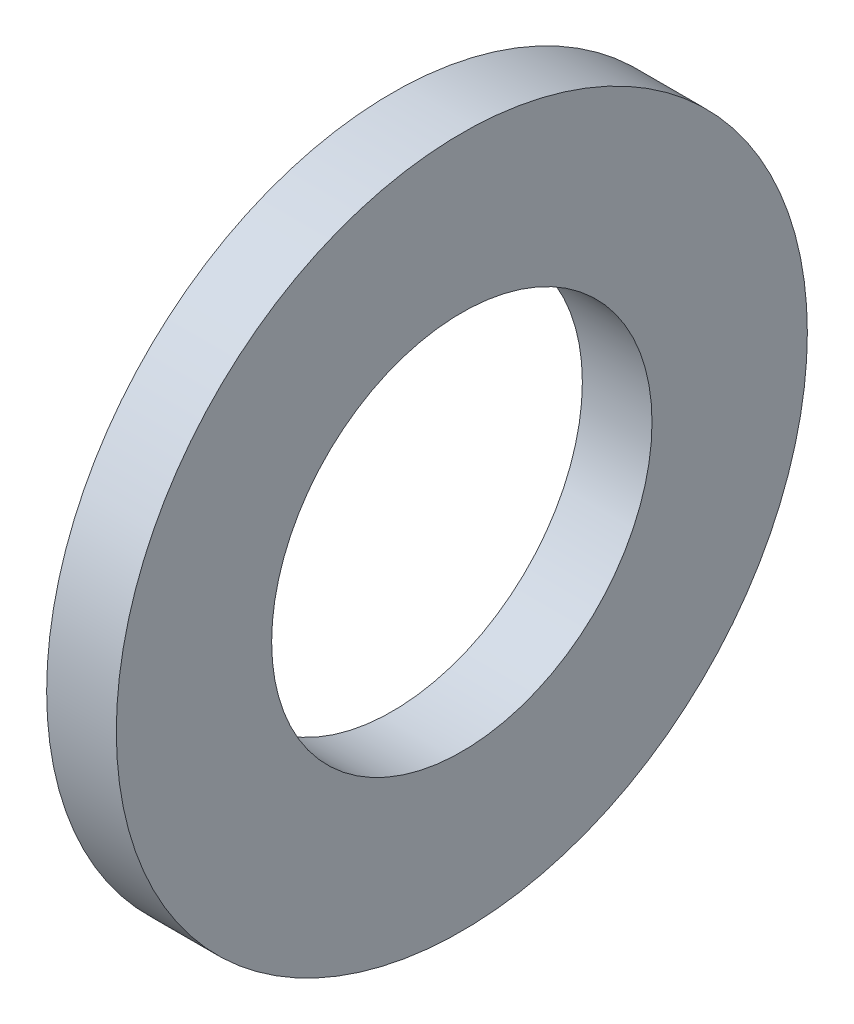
from build123d import *

# Parameters (mm, degrees)
SKETCH1_W = 1.6002
SKETCH1_H = 3.5687


with BuildPart() as part:
    # Sketch1 → Base-Revolve (revolve)
    with BuildSketch(Plane.XY, mode=Mode.PRIVATE) as base_revolve_sk:
        with Locations((-0.8001, 6.15315)):
            Rectangle(SKETCH1_W, SKETCH1_H)
    revolve(base_revolve_sk.sketch.rotate(Axis((-34.925, 0, 0), (1, 0, 0)), 90), axis=Axis((-34.925, 0, 0), (1, 0, 0)))


solid = part.part
